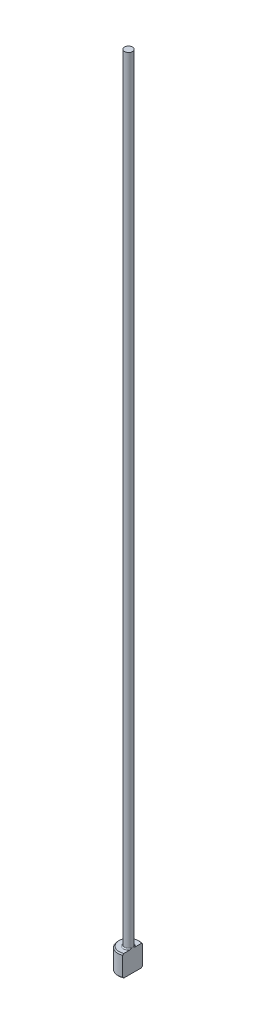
from build123d import *
from build123d.topology import SkipClean

# Parameters (mm, degrees)
CHAMFER1_SIZE    = 0.2
FILLET1_R        = 0.2
KEYED_HEAD_DEPTH = 151.026664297


with BuildPart() as part:
    # Sketch1 → Revolve1 (revolve)
    with BuildSketch(Plane.XY, mode=Mode.PRIVATE) as revolve1_sk:
        Polygon((0, 0), (-2, 0), (-2, 4), (-0.75, 4), (-0.75, 150), (0, 150), align=None)
    revolve(revolve1_sk.sketch.rotate(Axis((0, 259.958771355, 0), (0, -1, 0)), 270), axis=Axis((0, 259.958771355, 0), (0, -1, 0)))

    # Chamfer1
    chamfer1_edges = [part.edges().sort_by_distance(p)[0] for p in [
        (0, 4, -2),
        (0, 0, -2),
    ]]
    chamfer(chamfer1_edges, length=CHAMFER1_SIZE)

    # Fillet1
    fillet1_edges = [part.edges().sort_by_distance(p)[0] for p in [
        (0, 4, -0.75),
    ]]
    fillet(fillet1_edges, radius=FILLET1_R)

    # Sketch2 → KEYED HEAD (cut, through all)
    with SkipClean():  # the faces are left unmerged after this step: merging them gives an invalid solid
        with BuildSketch(Plane(origin=(0, 0, 0), x_dir=(1, 0, 0), z_dir=(0, 1, 0))):
            with BuildLine():
                Line((0.75, -1.854049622), (0.75, 1.854049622))
                ThreePointArc((0.75, 1.854049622), (2, 0), (0.75, -1.854049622))
            make_face()
        extrude(amount=KEYED_HEAD_DEPTH, mode=Mode.SUBTRACT)


solid = part.part
